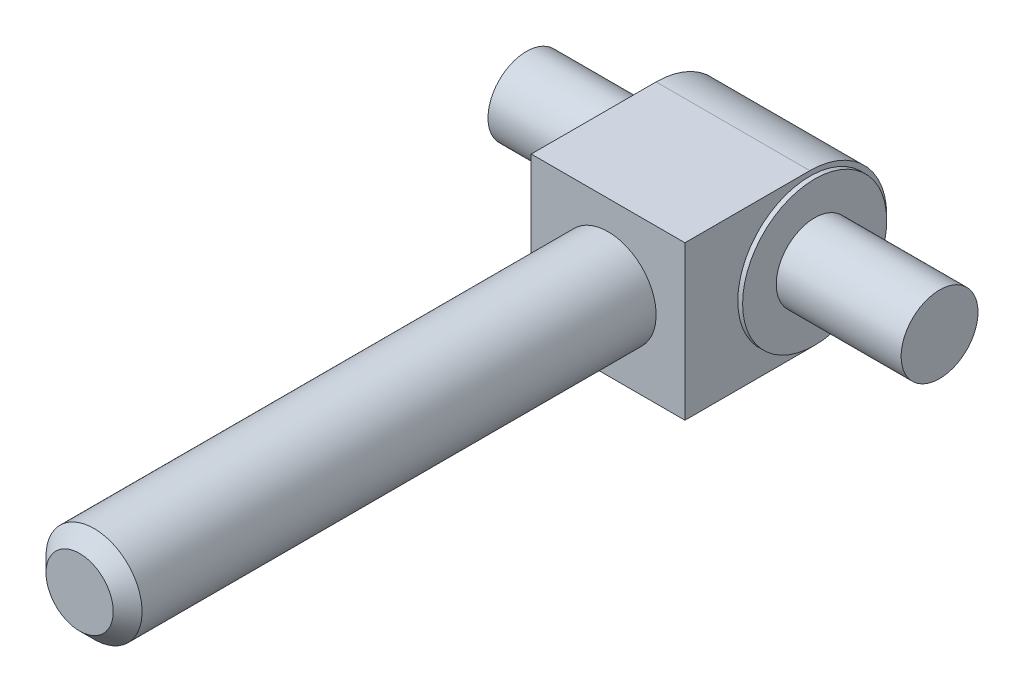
ISO-10303-21;
HEADER;
FILE_DESCRIPTION(('STEP AP214'),'2;1');
FILE_NAME('part.step','',(''),(''),'','','');
FILE_SCHEMA(('AUTOMOTIVE_DESIGN { 1 0 10303 214 1 1 1 1 }'));
ENDSEC;
DATA;
#1=APPLICATION_CONTEXT('core data for automotive mechanical design processes');
#2=APPLICATION_PROTOCOL_DEFINITION('international standard','automotive_design',2000,#1);
#3=PRODUCT_CONTEXT('',#1,'mechanical');
#4=PRODUCT('Part','Part','',(#3));
#5=PRODUCT_RELATED_PRODUCT_CATEGORY('part','',(#4));
#6=PRODUCT_DEFINITION_FORMATION('','',#4);
#7=PRODUCT_DEFINITION_CONTEXT('part definition',#1,'design');
#8=PRODUCT_DEFINITION('design','',#6,#7);
#9=PRODUCT_DEFINITION_SHAPE('','',#8);
#10=(LENGTH_UNIT() NAMED_UNIT(*) SI_UNIT(.MILLI.,.METRE.));
#11=(NAMED_UNIT(*) PLANE_ANGLE_UNIT() SI_UNIT($,.RADIAN.));
#12=(NAMED_UNIT(*) SI_UNIT($,.STERADIAN.) SOLID_ANGLE_UNIT());
#13=UNCERTAINTY_MEASURE_WITH_UNIT(LENGTH_MEASURE(1.E-05),#10,'distance_accuracy_value','');
#14=(GEOMETRIC_REPRESENTATION_CONTEXT(3) GLOBAL_UNCERTAINTY_ASSIGNED_CONTEXT((#13)) GLOBAL_UNIT_ASSIGNED_CONTEXT((#10,
#11,#12)) REPRESENTATION_CONTEXT('',''));
#15=CARTESIAN_POINT('',(0.,0.,0.));
#16=DIRECTION('',(0.,0.,1.));
#17=DIRECTION('',(1.,0.,0.));
#18=AXIS2_PLACEMENT_3D('',#15,#16,#17);
#19=CARTESIAN_POINT('',(-8.,-8.,-8.));
#20=DIRECTION('',(1.,0.,0.));
#21=DIRECTION('',(0.,1.,0.));
#22=AXIS2_PLACEMENT_3D('',#19,#20,#21);
#23=PLANE('',#22);
#24=CARTESIAN_POINT('',(-8.,0.,0.));
#25=DIRECTION('',(1.,0.,0.));
#26=DIRECTION('',(0.,1.,0.));
#27=AXIS2_PLACEMENT_3D('',#24,#25,#26);
#28=CIRCLE('',#27,8.);
#29=CARTESIAN_POINT('',(-8.,8.,0.));
#30=VERTEX_POINT('',#29);
#31=CARTESIAN_POINT('',(-8.,0.,-8.));
#32=VERTEX_POINT('',#31);
#33=EDGE_CURVE('E29',#30,#32,#28,.F.);
#34=ORIENTED_EDGE('',*,*,#33,.T.);
#35=CARTESIAN_POINT('',(-8.,0.,0.));
#36=DIRECTION('',(1.,0.,0.));
#37=DIRECTION('',(0.,1.,0.));
#38=AXIS2_PLACEMENT_3D('',#35,#36,#37);
#39=CIRCLE('',#38,8.);
#40=CARTESIAN_POINT('',(-8.,-8.,0.));
#41=VERTEX_POINT('',#40);
#42=EDGE_CURVE('E94',#32,#41,#39,.F.);
#43=ORIENTED_EDGE('',*,*,#42,.T.);
#44=DIRECTION('',(0.,0.,1.));
#45=VECTOR('',#44,1.);
#46=CARTESIAN_POINT('',(-8.,-8.,-8.));
#47=LINE('',#46,#45);
#48=CARTESIAN_POINT('',(-8.,-8.,13.));
#49=VERTEX_POINT('',#48);
#50=EDGE_CURVE('E66',#41,#49,#47,.T.);
#51=ORIENTED_EDGE('',*,*,#50,.T.);
#52=DIRECTION('',(0.,1.,0.));
#53=VECTOR('',#52,1.);
#54=CARTESIAN_POINT('',(-8.,-8.,13.));
#55=LINE('',#54,#53);
#56=CARTESIAN_POINT('',(-8.,8.,13.));
#57=VERTEX_POINT('',#56);
#58=EDGE_CURVE('E61',#49,#57,#55,.T.);
#59=ORIENTED_EDGE('',*,*,#58,.T.);
#60=DIRECTION('',(0.,0.,1.));
#61=VECTOR('',#60,1.);
#62=CARTESIAN_POINT('',(-8.,8.,-8.));
#63=LINE('',#62,#61);
#64=EDGE_CURVE('E64',#30,#57,#63,.T.);
#65=ORIENTED_EDGE('',*,*,#64,.F.);
#66=EDGE_LOOP('',(#34,#43,#51,#59,#65));
#67=FACE_BOUND('',#66,.T.);
#68=CARTESIAN_POINT('',(-8.,0.,0.));
#69=DIRECTION('',(1.,0.,0.));
#70=DIRECTION('',(0.,1.,0.));
#71=AXIS2_PLACEMENT_3D('',#68,#69,#70);
#72=CIRCLE('',#71,7.5);
#73=CARTESIAN_POINT('',(-8.,7.5,0.));
#74=VERTEX_POINT('',#73);
#75=EDGE_CURVE('E9',#74,#74,#72,.F.);
#76=ORIENTED_EDGE('',*,*,#75,.F.);
#77=EDGE_LOOP('',(#76));
#78=FACE_BOUND('',#77,.T.);
#79=ADVANCED_FACE('F14',(#67,#78),#23,.F.);
#80=CARTESIAN_POINT('',(8.,8.,-8.));
#81=DIRECTION('',(-1.,0.,0.));
#82=DIRECTION('',(0.,0.,-1.));
#83=AXIS2_PLACEMENT_3D('',#80,#81,#82);
#84=PLANE('',#83);
#85=DIRECTION('',(0.,0.,1.));
#86=VECTOR('',#85,1.);
#87=CARTESIAN_POINT('',(8.,-8.,-8.));
#88=LINE('',#87,#86);
#89=CARTESIAN_POINT('',(8.,-8.,0.));
#90=VERTEX_POINT('',#89);
#91=CARTESIAN_POINT('',(8.,-8.,13.));
#92=VERTEX_POINT('',#91);
#93=EDGE_CURVE('E83',#90,#92,#88,.T.);
#94=ORIENTED_EDGE('',*,*,#93,.F.);
#95=CARTESIAN_POINT('',(8.,0.,0.));
#96=DIRECTION('',(-1.,0.,0.));
#97=DIRECTION('',(0.,0.,-1.));
#98=AXIS2_PLACEMENT_3D('',#95,#96,#97);
#99=CIRCLE('',#98,8.);
#100=CARTESIAN_POINT('',(8.,0.,-8.));
#101=VERTEX_POINT('',#100);
#102=EDGE_CURVE('E91',#90,#101,#99,.F.);
#103=ORIENTED_EDGE('',*,*,#102,.T.);
#104=CARTESIAN_POINT('',(8.,0.,0.));
#105=DIRECTION('',(-1.,0.,0.));
#106=DIRECTION('',(0.,0.,-1.));
#107=AXIS2_PLACEMENT_3D('',#104,#105,#106);
#108=CIRCLE('',#107,8.);
#109=CARTESIAN_POINT('',(8.,8.,0.));
#110=VERTEX_POINT('',#109);
#111=EDGE_CURVE('E89',#101,#110,#108,.F.);
#112=ORIENTED_EDGE('',*,*,#111,.T.);
#113=DIRECTION('',(0.,0.,1.));
#114=VECTOR('',#113,1.);
#115=CARTESIAN_POINT('',(8.,8.,-8.));
#116=LINE('',#115,#114);
#117=CARTESIAN_POINT('',(8.,8.,13.));
#118=VERTEX_POINT('',#117);
#119=EDGE_CURVE('E81',#110,#118,#116,.T.);
#120=ORIENTED_EDGE('',*,*,#119,.T.);
#121=DIRECTION('',(0.,-1.,0.));
#122=VECTOR('',#121,1.);
#123=CARTESIAN_POINT('',(8.,8.,13.));
#124=LINE('',#123,#122);
#125=EDGE_CURVE('E77',#118,#92,#124,.T.);
#126=ORIENTED_EDGE('',*,*,#125,.T.);
#127=EDGE_LOOP('',(#94,#103,#112,#120,#126));
#128=FACE_BOUND('',#127,.T.);
#129=CARTESIAN_POINT('',(8.,0.,0.));
#130=DIRECTION('',(-1.,0.,0.));
#131=DIRECTION('',(0.,0.,1.));
#132=AXIS2_PLACEMENT_3D('',#129,#130,#131);
#133=CIRCLE('',#132,7.5);
#134=CARTESIAN_POINT('',(8.,0.,7.5));
#135=VERTEX_POINT('',#134);
#136=EDGE_CURVE('E22',#135,#135,#133,.F.);
#137=ORIENTED_EDGE('',*,*,#136,.F.);
#138=EDGE_LOOP('',(#137));
#139=FACE_BOUND('',#138,.T.);
#140=ADVANCED_FACE('F107',(#128,#139),#84,.F.);
#141=CARTESIAN_POINT('',(-8.,8.,13.));
#142=DIRECTION('',(0.,0.,1.));
#143=DIRECTION('',(-1.,0.,0.));
#144=AXIS2_PLACEMENT_3D('',#141,#142,#143);
#145=PLANE('',#144);
#146=DIRECTION('',(1.,0.,0.));
#147=VECTOR('',#146,1.);
#148=CARTESIAN_POINT('',(-8.,-8.,13.));
#149=LINE('',#148,#147);
#150=EDGE_CURVE('E71',#49,#92,#149,.T.);
#151=ORIENTED_EDGE('',*,*,#150,.T.);
#152=ORIENTED_EDGE('',*,*,#125,.F.);
#153=DIRECTION('',(-1.,0.,0.));
#154=VECTOR('',#153,1.);
#155=CARTESIAN_POINT('',(8.,8.,13.));
#156=LINE('',#155,#154);
#157=EDGE_CURVE('E74',#118,#57,#156,.T.);
#158=ORIENTED_EDGE('',*,*,#157,.T.);
#159=ORIENTED_EDGE('',*,*,#58,.F.);
#160=EDGE_LOOP('',(#151,#152,#158,#159));
#161=FACE_BOUND('',#160,.T.);
#162=CARTESIAN_POINT('',(0.,0.,13.));
#163=DIRECTION('',(0.,0.,1.));
#164=DIRECTION('',(-1.,0.,0.));
#165=AXIS2_PLACEMENT_3D('',#162,#163,#164);
#166=CIRCLE('',#165,5.);
#167=CARTESIAN_POINT('',(-5.,0.,13.));
#168=VERTEX_POINT('',#167);
#169=EDGE_CURVE('E140',#168,#168,#166,.T.);
#170=ORIENTED_EDGE('',*,*,#169,.F.);
#171=EDGE_LOOP('',(#170));
#172=FACE_BOUND('',#171,.T.);
#173=ADVANCED_FACE('F75',(#161,#172),#145,.T.);
#174=CARTESIAN_POINT('',(8.,8.,-8.));
#175=DIRECTION('',(0.,1.,0.));
#176=DIRECTION('',(-1.,0.,0.));
#177=AXIS2_PLACEMENT_3D('',#174,#175,#176);
#178=PLANE('',#177);
#179=ORIENTED_EDGE('',*,*,#119,.F.);
#180=DIRECTION('',(-1.,0.,0.));
#181=VECTOR('',#180,1.);
#182=CARTESIAN_POINT('',(8.,8.,0.));
#183=LINE('',#182,#181);
#184=EDGE_CURVE('E37',#110,#30,#183,.T.);
#185=ORIENTED_EDGE('',*,*,#184,.T.);
#186=ORIENTED_EDGE('',*,*,#64,.T.);
#187=ORIENTED_EDGE('',*,*,#157,.F.);
#188=EDGE_LOOP('',(#179,#185,#186,#187));
#189=FACE_BOUND('',#188,.T.);
#190=ADVANCED_FACE('F80',(#189),#178,.T.);
#191=CARTESIAN_POINT('',(-8.,-8.,-8.));
#192=DIRECTION('',(0.,-1.,0.));
#193=DIRECTION('',(1.,0.,0.));
#194=AXIS2_PLACEMENT_3D('',#191,#192,#193);
#195=PLANE('',#194);
#196=ORIENTED_EDGE('',*,*,#50,.F.);
#197=DIRECTION('',(1.,0.,0.));
#198=VECTOR('',#197,1.);
#199=CARTESIAN_POINT('',(-8.,-8.,0.));
#200=LINE('',#199,#198);
#201=EDGE_CURVE('E70',#41,#90,#200,.T.);
#202=ORIENTED_EDGE('',*,*,#201,.T.);
#203=ORIENTED_EDGE('',*,*,#93,.T.);
#204=ORIENTED_EDGE('',*,*,#150,.F.);
#205=EDGE_LOOP('',(#196,#202,#203,#204));
#206=FACE_BOUND('',#205,.T.);
#207=ADVANCED_FACE('F121',(#206),#195,.T.);
#208=CARTESIAN_POINT('',(8.,0.,0.));
#209=DIRECTION('',(1.,0.,0.));
#210=DIRECTION('',(0.,1.,0.));
#211=AXIS2_PLACEMENT_3D('',#208,#209,#210);
#212=CYLINDRICAL_SURFACE('',#211,8.);
#213=DIRECTION('',(-1.,0.,0.));
#214=VECTOR('',#213,1.);
#215=CARTESIAN_POINT('',(8.,0.,-8.));
#216=LINE('',#215,#214);
#217=EDGE_CURVE('E154',#32,#101,#216,.F.);
#218=ORIENTED_EDGE('',*,*,#217,.F.);
#219=ORIENTED_EDGE('',*,*,#33,.F.);
#220=ORIENTED_EDGE('',*,*,#184,.F.);
#221=ORIENTED_EDGE('',*,*,#111,.F.);
#222=EDGE_LOOP('',(#218,#219,#220,#221));
#223=FACE_BOUND('',#222,.T.);
#224=ADVANCED_FACE('F164',(#223),#212,.T.);
#225=CARTESIAN_POINT('',(-8.,0.,0.));
#226=DIRECTION('',(-1.,0.,0.));
#227=DIRECTION('',(0.,-1.,0.));
#228=AXIS2_PLACEMENT_3D('',#225,#226,#227);
#229=CYLINDRICAL_SURFACE('',#228,8.);
#230=ORIENTED_EDGE('',*,*,#42,.F.);
#231=ORIENTED_EDGE('',*,*,#217,.T.);
#232=ORIENTED_EDGE('',*,*,#102,.F.);
#233=ORIENTED_EDGE('',*,*,#201,.F.);
#234=EDGE_LOOP('',(#230,#231,#232,#233));
#235=FACE_BOUND('',#234,.T.);
#236=ADVANCED_FACE('F127',(#235),#229,.T.);
#237=CARTESIAN_POINT('',(0.,0.,68.));
#238=DIRECTION('',(0.,0.,1.));
#239=DIRECTION('',(-1.,0.,0.));
#240=AXIS2_PLACEMENT_3D('',#237,#238,#239);
#241=PLANE('',#240);
#242=CARTESIAN_POINT('',(0.,0.,68.));
#243=DIRECTION('',(0.,0.,1.));
#244=DIRECTION('',(-1.,0.,0.));
#245=AXIS2_PLACEMENT_3D('',#242,#243,#244);
#246=CIRCLE('',#245,3.5);
#247=CARTESIAN_POINT('',(-3.5,0.,68.));
#248=VERTEX_POINT('',#247);
#249=EDGE_CURVE('E97',#248,#248,#246,.T.);
#250=ORIENTED_EDGE('',*,*,#249,.T.);
#251=EDGE_LOOP('',(#250));
#252=FACE_BOUND('',#251,.T.);
#253=ADVANCED_FACE('F124',(#252),#241,.T.);
#254=CARTESIAN_POINT('',(0.,0.,68.));
#255=DIRECTION('',(0.,0.,-1.));
#256=DIRECTION('',(1.,0.,0.));
#257=AXIS2_PLACEMENT_3D('',#254,#255,#256);
#258=CYLINDRICAL_SURFACE('',#257,5.);
#259=CARTESIAN_POINT('',(0.,0.,66.5));
#260=DIRECTION('',(0.,0.,1.));
#261=DIRECTION('',(-1.,0.,0.));
#262=AXIS2_PLACEMENT_3D('',#259,#260,#261);
#263=CIRCLE('',#262,5.);
#264=CARTESIAN_POINT('',(-5.,0.,66.5));
#265=VERTEX_POINT('',#264);
#266=EDGE_CURVE('E100',#265,#265,#263,.F.);
#267=ORIENTED_EDGE('',*,*,#266,.T.);
#268=EDGE_LOOP('',(#267));
#269=FACE_BOUND('',#268,.T.);
#270=ORIENTED_EDGE('',*,*,#169,.T.);
#271=EDGE_LOOP('',(#270));
#272=FACE_BOUND('',#271,.T.);
#273=ADVANCED_FACE('F126',(#269,#272),#258,.T.);
#274=CARTESIAN_POINT('',(0.,0.,68.));
#275=DIRECTION('',(0.,0.,-1.));
#276=DIRECTION('',(1.,0.,0.));
#277=AXIS2_PLACEMENT_3D('',#274,#275,#276);
#278=CONICAL_SURFACE('',#277,3.5,0.785398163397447);
#279=ORIENTED_EDGE('',*,*,#266,.F.);
#280=EDGE_LOOP('',(#279));
#281=FACE_BOUND('',#280,.T.);
#282=ORIENTED_EDGE('',*,*,#249,.F.);
#283=EDGE_LOOP('',(#282));
#284=FACE_BOUND('',#283,.T.);
#285=ADVANCED_FACE('F16',(#281,#284),#278,.T.);
#286=CARTESIAN_POINT('',(8.5,0.,0.));
#287=DIRECTION('',(1.,0.,0.));
#288=DIRECTION('',(0.,0.,-1.));
#289=AXIS2_PLACEMENT_3D('',#286,#287,#288);
#290=PLANE('',#289);
#291=CARTESIAN_POINT('',(8.5,0.,0.));
#292=DIRECTION('',(1.,0.,0.));
#293=DIRECTION('',(0.,0.,-1.));
#294=AXIS2_PLACEMENT_3D('',#291,#292,#293);
#295=CIRCLE('',#294,7.5);
#296=CARTESIAN_POINT('',(8.5,0.,-7.5));
#297=VERTEX_POINT('',#296);
#298=EDGE_CURVE('E142',#297,#297,#295,.T.);
#299=ORIENTED_EDGE('',*,*,#298,.T.);
#300=EDGE_LOOP('',(#299));
#301=FACE_BOUND('',#300,.T.);
#302=CARTESIAN_POINT('',(8.5,0.,0.));
#303=DIRECTION('',(1.,0.,0.));
#304=DIRECTION('',(0.,0.,-1.));
#305=AXIS2_PLACEMENT_3D('',#302,#303,#304);
#306=CIRCLE('',#305,4.);
#307=CARTESIAN_POINT('',(8.5,0.,-4.));
#308=VERTEX_POINT('',#307);
#309=EDGE_CURVE('E148',#308,#308,#306,.T.);
#310=ORIENTED_EDGE('',*,*,#309,.F.);
#311=EDGE_LOOP('',(#310));
#312=FACE_BOUND('',#311,.T.);
#313=ADVANCED_FACE('F134',(#301,#312),#290,.T.);
#314=CARTESIAN_POINT('',(8.5,0.,0.));
#315=DIRECTION('',(-1.,0.,0.));
#316=DIRECTION('',(0.,0.,1.));
#317=AXIS2_PLACEMENT_3D('',#314,#315,#316);
#318=CYLINDRICAL_SURFACE('',#317,7.5);
#319=ORIENTED_EDGE('',*,*,#298,.F.);
#320=EDGE_LOOP('',(#319));
#321=FACE_BOUND('',#320,.T.);
#322=ORIENTED_EDGE('',*,*,#136,.T.);
#323=EDGE_LOOP('',(#322));
#324=FACE_BOUND('',#323,.T.);
#325=ADVANCED_FACE('F105',(#321,#324),#318,.T.);
#326=CARTESIAN_POINT('',(21.5,0.,0.));
#327=DIRECTION('',(-1.,0.,0.));
#328=DIRECTION('',(0.,-1.,0.));
#329=AXIS2_PLACEMENT_3D('',#326,#327,#328);
#330=PLANE('',#329);
#331=CARTESIAN_POINT('',(21.5,0.,0.));
#332=DIRECTION('',(-1.,0.,0.));
#333=DIRECTION('',(0.,-1.,0.));
#334=AXIS2_PLACEMENT_3D('',#331,#332,#333);
#335=CIRCLE('',#334,4.);
#336=CARTESIAN_POINT('',(21.5,-4.,0.));
#337=VERTEX_POINT('',#336);
#338=EDGE_CURVE('E141',#337,#337,#335,.T.);
#339=ORIENTED_EDGE('',*,*,#338,.F.);
#340=EDGE_LOOP('',(#339));
#341=FACE_BOUND('',#340,.T.);
#342=ADVANCED_FACE('F184',(#341),#330,.F.);
#343=CARTESIAN_POINT('',(-21.5,0.,0.));
#344=DIRECTION('',(1.,0.,0.));
#345=DIRECTION('',(0.,1.,0.));
#346=AXIS2_PLACEMENT_3D('',#343,#344,#345);
#347=CYLINDRICAL_SURFACE('',#346,4.);
#348=ORIENTED_EDGE('',*,*,#309,.T.);
#349=EDGE_LOOP('',(#348));
#350=FACE_BOUND('',#349,.T.);
#351=ORIENTED_EDGE('',*,*,#338,.T.);
#352=EDGE_LOOP('',(#351));
#353=FACE_BOUND('',#352,.T.);
#354=ADVANCED_FACE('F179',(#350,#353),#347,.T.);
#355=CARTESIAN_POINT('',(-8.5,0.,0.));
#356=DIRECTION('',(-1.,0.,0.));
#357=DIRECTION('',(0.,-1.,0.));
#358=AXIS2_PLACEMENT_3D('',#355,#356,#357);
#359=PLANE('',#358);
#360=CARTESIAN_POINT('',(-8.5,0.,0.));
#361=DIRECTION('',(-1.,0.,0.));
#362=DIRECTION('',(0.,-1.,0.));
#363=AXIS2_PLACEMENT_3D('',#360,#361,#362);
#364=CIRCLE('',#363,7.5);
#365=CARTESIAN_POINT('',(-8.5,-7.5,0.));
#366=VERTEX_POINT('',#365);
#367=EDGE_CURVE('E207',#366,#366,#364,.T.);
#368=ORIENTED_EDGE('',*,*,#367,.T.);
#369=EDGE_LOOP('',(#368));
#370=FACE_BOUND('',#369,.T.);
#371=CARTESIAN_POINT('',(-8.5,0.,0.));
#372=DIRECTION('',(-1.,0.,0.));
#373=DIRECTION('',(0.,-1.,0.));
#374=AXIS2_PLACEMENT_3D('',#371,#372,#373);
#375=CIRCLE('',#374,4.);
#376=CARTESIAN_POINT('',(-8.5,-4.,0.));
#377=VERTEX_POINT('',#376);
#378=EDGE_CURVE('E210',#377,#377,#375,.T.);
#379=ORIENTED_EDGE('',*,*,#378,.F.);
#380=EDGE_LOOP('',(#379));
#381=FACE_BOUND('',#380,.T.);
#382=ADVANCED_FACE('F196',(#370,#381),#359,.T.);
#383=CARTESIAN_POINT('',(-8.5,0.,0.));
#384=DIRECTION('',(1.,0.,0.));
#385=DIRECTION('',(0.,1.,0.));
#386=AXIS2_PLACEMENT_3D('',#383,#384,#385);
#387=CYLINDRICAL_SURFACE('',#386,7.5);
#388=ORIENTED_EDGE('',*,*,#367,.F.);
#389=EDGE_LOOP('',(#388));
#390=FACE_BOUND('',#389,.T.);
#391=ORIENTED_EDGE('',*,*,#75,.T.);
#392=EDGE_LOOP('',(#391));
#393=FACE_BOUND('',#392,.T.);
#394=ADVANCED_FACE('F182',(#390,#393),#387,.T.);
#395=CARTESIAN_POINT('',(-21.5,0.,0.));
#396=DIRECTION('',(-1.,0.,0.));
#397=DIRECTION('',(0.,-1.,0.));
#398=AXIS2_PLACEMENT_3D('',#395,#396,#397);
#399=PLANE('',#398);
#400=CARTESIAN_POINT('',(-21.5,0.,0.));
#401=DIRECTION('',(-1.,0.,0.));
#402=DIRECTION('',(0.,-1.,0.));
#403=AXIS2_PLACEMENT_3D('',#400,#401,#402);
#404=CIRCLE('',#403,4.);
#405=CARTESIAN_POINT('',(-21.5,-4.,0.));
#406=VERTEX_POINT('',#405);
#407=EDGE_CURVE('E145',#406,#406,#404,.T.);
#408=ORIENTED_EDGE('',*,*,#407,.T.);
#409=EDGE_LOOP('',(#408));
#410=FACE_BOUND('',#409,.T.);
#411=ADVANCED_FACE('F177',(#410),#399,.T.);
#412=ORIENTED_EDGE('',*,*,#378,.T.);
#413=EDGE_LOOP('',(#412));
#414=FACE_BOUND('',#413,.T.);
#415=ORIENTED_EDGE('',*,*,#407,.F.);
#416=EDGE_LOOP('',(#415));
#417=FACE_BOUND('',#416,.T.);
#418=ADVANCED_FACE('F174',(#414,#417),#347,.T.);
#419=CLOSED_SHELL('',(#79,#140,#173,#190,#207,#224,#236,#253,#273,#285,#313,#325,#342,#354,#382,
#394,#411,#418));
#420=MANIFOLD_SOLID_BREP('B1',#419);
#421=ADVANCED_BREP_SHAPE_REPRESENTATION('',(#18,#420),#14);
#422=SHAPE_DEFINITION_REPRESENTATION(#9,#421);
ENDSEC;
END-ISO-10303-21;
